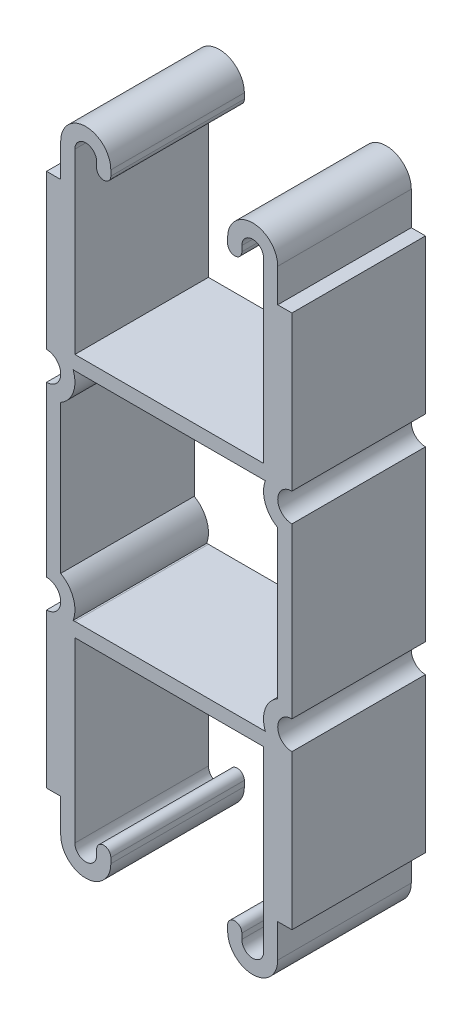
from build123d import *

# Parameters (mm, degrees)
BASE_EXTRUDE_DEPTH  = 12.7
BOSS_EXTRUDE1_DEPTH = 12.7


with BuildPart() as part:
    # Sketch1 → Base-Extrude (new, symmetric)
    with BuildSketch(Plane(origin=(0, 33.02, 0), x_dir=(1, 0, 0), z_dir=(0, 0, 1))):
        with BuildLine():
            Line((-20.6375, 24.13), (-20.6375, -9.6901))
            ThreePointArc((-20.6375, -9.6901), (-19.848914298, -11.593914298), (-17.9451, -12.3825))
            Line((-17.9451, -12.3825), (17.9451, -12.3825))
            ThreePointArc((17.9451, -12.3825), (19.848914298, -11.593914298), (20.6375, -9.6901))
            Line((20.6375, -9.6901), (20.6375, 24.13))
            ThreePointArc((20.6375, 24.13), (15.875, 28.8925), (11.1125, 24.13))
            Line((11.1125, 24.13), (11.1125, 23.09495))
            ThreePointArc((11.1125, 23.09495), (12.4587, 21.74875), (13.8049, 23.09495))
            Line((13.8049, 23.09495), (13.8049, 24.13))
            ThreePointArc((13.8049, 24.13), (15.875, 26.2001), (17.9451, 24.13))
            Line((17.9451, 24.13), (17.9451, -9.6901))
            Line((17.9451, -9.6901), (-17.9451, -9.6901))
            Line((-17.9451, -9.6901), (-17.9451, 24.13))
            ThreePointArc((-17.9451, 24.13), (-15.875, 26.2001), (-13.8049, 24.13))
            Line((-13.8049, 24.13), (-13.8049, 23.09495))
            ThreePointArc((-13.8049, 23.09495), (-12.4587, 21.74875), (-11.1125, 23.09495))
            Line((-11.1125, 23.09495), (-11.1125, 24.13))
            ThreePointArc((-11.1125, 24.13), (-15.875, 28.8925), (-20.6375, 24.13))
        make_face()
    base_extrude = extrude(amount=BASE_EXTRUDE_DEPTH, both=True)

    # Sketch2 → Boss-Extrude1 (add, symmetric)
    with BuildSketch(Plane.XY):
        with BuildLine():
            Line((-23.337499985, 50.8), (-23.337499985, 21.457899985))
            ThreePointArc((-23.337499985, 21.457899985), (-20.6375, 18.7579), (-23.337499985, 16.057900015))
            Line((-23.337499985, 16.057900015), (-23.337499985, -16.057900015))
            ThreePointArc((-23.337499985, -16.057900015), (-20.6375, -18.7579), (-23.337499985, -21.457899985))
            Line((-23.337499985, -21.457899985), (-23.337499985, -50.8))
            Line((-23.337499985, -50.8), (-20.6375, -50.8))
            Line((-20.6375, -50.8), (-20.6375, -23.434437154))
            ThreePointArc((-20.6375, -23.434437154), (-17.937500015, -18.7579), (-20.6375, -14.081362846))
            Line((-20.6375, -14.081362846), (-20.6375, 14.081362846))
            ThreePointArc((-20.6375, 14.081362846), (-17.937500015, 18.7579), (-20.6375, 23.434437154))
            Line((-20.6375, 23.434437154), (-20.6375, 50.8))
            Line((-20.6375, 50.8), (-23.337499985, 50.8))
        make_face()
    boss_extrude1 = extrude(amount=BOSS_EXTRUDE1_DEPTH, both=True)

    # Mirror1: Base-Extrude across plane
    add(base_extrude.mirror(Plane.ZX))

    # Mirror2: Boss-Extrude1 across plane
    add(boss_extrude1.mirror(Plane(origin=(0, 0, 0), x_dir=(0, 0, 1), z_dir=(1, 0, 0))))


solid = part.part
